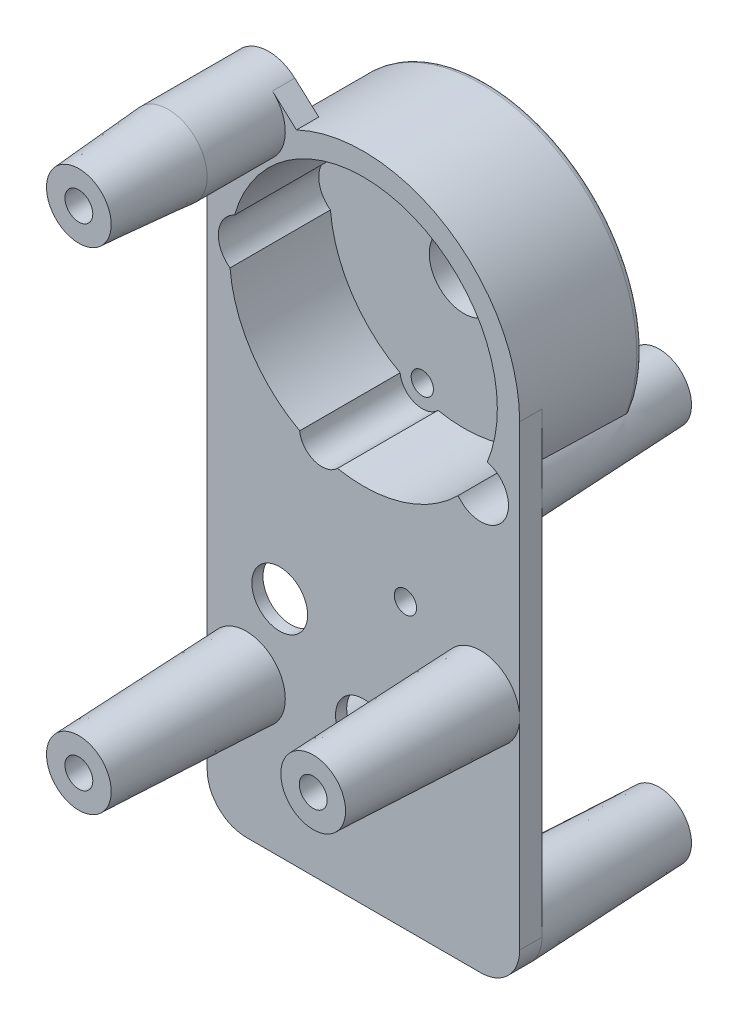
from build123d import *

# Parameters (mm, degrees)
EXTRUDE_1_DEPTH           = 2
SKETCH_3_R                = 3.5
EXTRUDE_2_DEPTH           = 15
EXTRUDE_2_DRAFT           = 2.29
EXTRUDE_2_PROFILE_2_DEPTH = 15
EXTRUDE_2_PROFILE_2_DRAFT = 2.29
SKETCH_4_R                = 3.5
EXTRUDE_3_DEPTH           = 7
SKETCH_5_R                = 3.5
EXTRUDE_4_DEPTH           = 8
EXTRUDE_4_TAPER           = 4.29
SKETCH_6_R                = 3.5
EXTRUDE_5_DEPTH           = 14
EXTRUDE_5_DRAFT           = 2.45
EXTRUDE_5_PROFILE_2_DEPTH = 14
EXTRUDE_5_PROFILE_2_DRAFT = 2.45
EXTRUDE_5_PROFILE_3_DEPTH = 14
EXTRUDE_5_PROFILE_3_DRAFT = 2.45
EXTRUDE_5_PROFILE_4_DEPTH = 14
EXTRUDE_5_PROFILE_4_DRAFT = 2.45
M3X0_5_1_D                = 2.5
M3X0_5_1_DEPTH            = 8.5
M3X0_5_1_TIP              = 0.751075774
M3X0_5_2_D                = 2.5
M3X0_5_2_DEPTH            = 8.5
M3X0_5_2_TIP              = 0.751075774
EXTRUDE_START             = -11
SKETCH_11_R               = 14
EXTRUDE_6_DEPTH           = 11
SKETCH_12_R               = 12
CUT_EXTRUDE_1_DEPTH       = 9
SKETCH_15_R               = 3
EXTRUDE_7_DEPTH           = 5.3
EXTRUDE_7_TAPER           = 5.4
SKETCH_17_R               = 2.5
SKETCH_17_R_2             = 2
CUT_EXTRUDE_2_DEPTH       = 9
SKETCH_18_R               = 3.1
SKETCH_18_R_2             = 1
SKETCH_18_R_3             = 2.5
CUT_EXTRUDE_3_DEPTH       = 52.129737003
SKETCH_19_R               = 4.5
CUT_EXTRUDE_4_DEPTH       = 1
FILLET_1_R                = 0.5


with BuildPart() as part:
    # Sketch 1 → Extrude 1 (new body)
    with BuildSketch(Plane.XY):
        with BuildLine():
            Line((-8.152204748, 45.595738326), (-6, 43.649110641))
            ThreePointArc((-6, 43.649110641), (7.483314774, 42.832159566), (14, 31))
            Line((14, 31), (14, -10))
            ThreePointArc((14, -10), (12.974873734, -12.474873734), (10.5, -13.5))
            Line((10.5, -13.5), (-10.5, -13.5))
            ThreePointArc((-10.5, -13.5), (-12.974873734, -12.474873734), (-14, -10))
            Line((-14, -10), (-14, 43))
            ThreePointArc((-14, 43), (-11.91998532, 46.19900636), (-8.152204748, 45.595738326))
        make_face()
    extrude(amount=EXTRUDE_1_DEPTH)


with BuildPart() as extrude_2_tool:
    # Sketch 3 → Extrude 2 (with draft: the straight prism first)
    with BuildSketch(Plane.XY.offset(2)):
        with Locations((10.5, 8)):
            Circle(SKETCH_3_R)
    extrude(amount=EXTRUDE_2_DEPTH)
    # Extrude 2: the draft: its side faces are tilted about the plane it starts from
    extrude_2_sides = [extrude_2_tool.faces().sort_by_distance(p)[0] for p in [
        (7, 8, 9.5),
    ]]
    draft(extrude_2_sides, Plane.XY.offset(2), EXTRUDE_2_DRAFT)


with BuildPart() as part_1:
    add(part.part)

    # Extrude 2: add extrude_2_tool
    add(extrude_2_tool.part)


with BuildPart() as extrude_2_profile_2_tool:
    # Sketch 3 → Extrude 2 profile 2 (with draft: the straight prism first)
    with BuildSketch(Plane.XY.offset(2)):
        with Locations((-10.5, -1)):
            Circle(SKETCH_3_R)
    extrude(amount=EXTRUDE_2_PROFILE_2_DEPTH)
    # Extrude 2 profile 2: the draft: its side faces are tilted about the plane it starts from
    extrude_2_profile_2_sides = [extrude_2_profile_2_tool.faces().sort_by_distance(p)[0] for p in [
        (-14, -1, 9.5),
    ]]
    draft(extrude_2_profile_2_sides, Plane.XY.offset(2), EXTRUDE_2_PROFILE_2_DRAFT)


with BuildPart() as part_2:
    add(part_1.part)

    # Extrude 2 profile 2: add extrude_2_profile_2_tool
    add(extrude_2_profile_2_tool.part)

    # Sketch 4 → Extrude 3 (add)
    with BuildSketch(Plane.XY.offset(2)):
        with Locations(Location((-10.5, 43, 0), (0, 0, 180))):
            Circle(SKETCH_4_R)
    extrude(amount=EXTRUDE_3_DEPTH)

    # Sketch 5 → Extrude 4 (add)
    with BuildSketch(Plane.XY.offset(9)):
        with Locations(Location((-10.5, 43, 0), (0, 0, 180))):
            Circle(SKETCH_5_R)
    extrude(amount=EXTRUDE_4_DEPTH, taper=EXTRUDE_4_TAPER)


with BuildPart() as extrude_5_tool:
    # Sketch 6 → Extrude 5 (with draft: the straight prism first)
    with BuildSketch(Plane(origin=(0, 0, 0), x_dir=(-1, 0, 0), z_dir=(0, 0, -1))):
        with Locations((10.5, 32)):
            Circle(SKETCH_6_R)
    extrude(amount=EXTRUDE_5_DEPTH)
    # Extrude 5: the draft: its side faces are tilted about the plane it starts from
    extrude_5_sides = [extrude_5_tool.faces().sort_by_distance(p)[0] for p in [
        (-7, 32, -7),
    ]]
    draft(extrude_5_sides, Plane(origin=(0, 0, 0), x_dir=(-1, 0, 0), z_dir=(0, 0, -1)), EXTRUDE_5_DRAFT)


with BuildPart() as part_3:
    add(part_2.part)

    # Extrude 5: add extrude_5_tool
    add(extrude_5_tool.part)


with BuildPart() as extrude_5_profile_2_tool:
    # Sketch 6 → Extrude 5 profile 2 (with draft: the straight prism first)
    with BuildSketch(Plane(origin=(0, 0, 0), x_dir=(-1, 0, 0), z_dir=(0, 0, -1))):
        with Locations((10.5, -10)):
            Circle(SKETCH_6_R)
    extrude(amount=EXTRUDE_5_PROFILE_2_DEPTH)
    # Extrude 5 profile 2: the draft: its side faces are tilted about the plane it starts from
    extrude_5_profile_2_sides = [extrude_5_profile_2_tool.faces().sort_by_distance(p)[0] for p in [
        (-7, -10, -7),
    ]]
    draft(extrude_5_profile_2_sides, Plane(origin=(0, 0, 0), x_dir=(-1, 0, 0), z_dir=(0, 0, -1)), EXTRUDE_5_PROFILE_2_DRAFT)


with BuildPart() as part_4:
    add(part_3.part)

    # Extrude 5 profile 2: add extrude_5_profile_2_tool
    add(extrude_5_profile_2_tool.part)


with BuildPart() as extrude_5_profile_3_tool:
    # Sketch 6 → Extrude 5 profile 3 (with draft: the straight prism first)
    with BuildSketch(Plane(origin=(0, 0, 0), x_dir=(-1, 0, 0), z_dir=(0, 0, -1))):
        with Locations((-10.5, -10)):
            Circle(SKETCH_6_R)
    extrude(amount=EXTRUDE_5_PROFILE_3_DEPTH)
    # Extrude 5 profile 3: the draft: its side faces are tilted about the plane it starts from
    extrude_5_profile_3_sides = [extrude_5_profile_3_tool.faces().sort_by_distance(p)[0] for p in [
        (14, -10, -7),
    ]]
    draft(extrude_5_profile_3_sides, Plane(origin=(0, 0, 0), x_dir=(-1, 0, 0), z_dir=(0, 0, -1)), EXTRUDE_5_PROFILE_3_DRAFT)


with BuildPart() as part_5:
    add(part_4.part)

    # Extrude 5 profile 3: add extrude_5_profile_3_tool
    add(extrude_5_profile_3_tool.part)


with BuildPart() as extrude_5_profile_4_tool:
    # Sketch 6 → Extrude 5 profile 4 (with draft: the straight prism first)
    with BuildSketch(Plane(origin=(0, 0, 0), x_dir=(-1, 0, 0), z_dir=(0, 0, -1))):
        with Locations((-10.5, 24)):
            Circle(SKETCH_6_R)
    extrude(amount=EXTRUDE_5_PROFILE_4_DEPTH)
    # Extrude 5 profile 4: the draft: its side faces are tilted about the plane it starts from
    extrude_5_profile_4_sides = [extrude_5_profile_4_tool.faces().sort_by_distance(p)[0] for p in [
        (14, 24, -7),
    ]]
    draft(extrude_5_profile_4_sides, Plane(origin=(0, 0, 0), x_dir=(-1, 0, 0), z_dir=(0, 0, -1)), EXTRUDE_5_PROFILE_4_DRAFT)


with BuildPart() as part_6:
    add(part_5.part)

    # Extrude 5 profile 4: add extrude_5_profile_4_tool
    add(extrude_5_profile_4_tool.part)

    # M3x0.5 _1
    with Locations(Plane.XY.offset(17)):
        with Locations((-10.5, 43), (-10.5, -1), (10.5, 8)):
            Hole(M3X0_5_1_D / 2, depth=M3X0_5_1_DEPTH)
            with Locations((0, 0, -(M3X0_5_1_DEPTH + M3X0_5_1_TIP / 2))):  # 118° drill point
                Cone(0, M3X0_5_1_D / 2, M3X0_5_1_TIP, mode=Mode.SUBTRACT)

    # M3x0.5 _2
    with Locations(Plane(origin=(0, 0, -14), x_dir=(-1, 0, 0), z_dir=(0, 0, -1))):
        with Locations((10.5, 32), (-10.5, 24), (-10.5, -10), (10.5, -10)):
            Hole(M3X0_5_2_D / 2, depth=M3X0_5_2_DEPTH)
            with Locations((0, 0, -(M3X0_5_2_DEPTH + M3X0_5_2_TIP / 2))):  # 118° drill point
                Cone(0, M3X0_5_2_D / 2, M3X0_5_2_TIP, mode=Mode.SUBTRACT)

    # Sketch 11 → Extrude 6 (add)
    with BuildSketch(Plane.XY.offset(2).offset(EXTRUDE_START)):
        with Locations((0, 31)):
            Circle(SKETCH_11_R)
    extrude(amount=EXTRUDE_6_DEPTH)

    # Sketch 12 → Cut-Extrude 1 (cut)
    with BuildSketch(Plane.XY.offset(2)):
        with Locations((0, 31)):
            Circle(SKETCH_12_R)
    extrude(amount=-CUT_EXTRUDE_1_DEPTH, mode=Mode.SUBTRACT)

    # Sketch 15 → Extrude 7 (add)
    with BuildSketch(Plane(origin=(0, 0, 0), x_dir=(-1, 0, 0), z_dir=(0, 0, -1))):
        with Locations((-3.76388309, 11.919865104)):
            Circle(SKETCH_15_R)
    extrude(amount=EXTRUDE_7_DEPTH, taper=EXTRUDE_7_TAPER)

    # Sketch 17 → Cut-Extrude 2 (cut)
    with BuildSketch(Plane.XY.offset(2)):
        with Locations((-10.5, 32)):
            Circle(SKETCH_17_R)
        with Locations((-3.722786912, 20.649113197)):
            Circle(SKETCH_17_R_2)
        with Locations((10.5, 24)):
            Circle(SKETCH_17_R)
    extrude(amount=-CUT_EXTRUDE_2_DEPTH, mode=Mode.SUBTRACT)

    # Sketch 18 → Cut-Extrude 3 (cut, through all)
    with BuildSketch(Plane.XY.offset(2)):
        with Locations((0, 31)):
            Circle(SKETCH_18_R)
        with Locations((3.76388309, 11.919865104)):
            Circle(SKETCH_18_R_2)
        with Locations((-3.722786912, 20.649113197)):
            Circle(SKETCH_18_R_2)
        with Locations((-7.5, 6.5)):
            Circle(SKETCH_18_R_3)
        Circle(SKETCH_18_R_3)
    extrude(amount=-CUT_EXTRUDE_3_DEPTH, mode=Mode.SUBTRACT)

    # Sketch 19 → Cut-Extrude 4 (cut)
    with BuildSketch(Plane(origin=(0, 0, 0), x_dir=(-1, 0, 0), z_dir=(0, 0, -1))):
        with Locations((7.5, 6.5)):
            Circle(SKETCH_19_R)
        Circle(SKETCH_19_R)
    extrude(amount=-CUT_EXTRUDE_4_DEPTH, mode=Mode.SUBTRACT)

    # Fillet 1
    fillet_1_edges = [part_6.edges().sort_by_distance(p)[0] for p in [
        (-12.899033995, 36.44195939, -9),
    ]]
    fillet(fillet_1_edges, radius=FILLET_1_R)


solid = part_6.part
